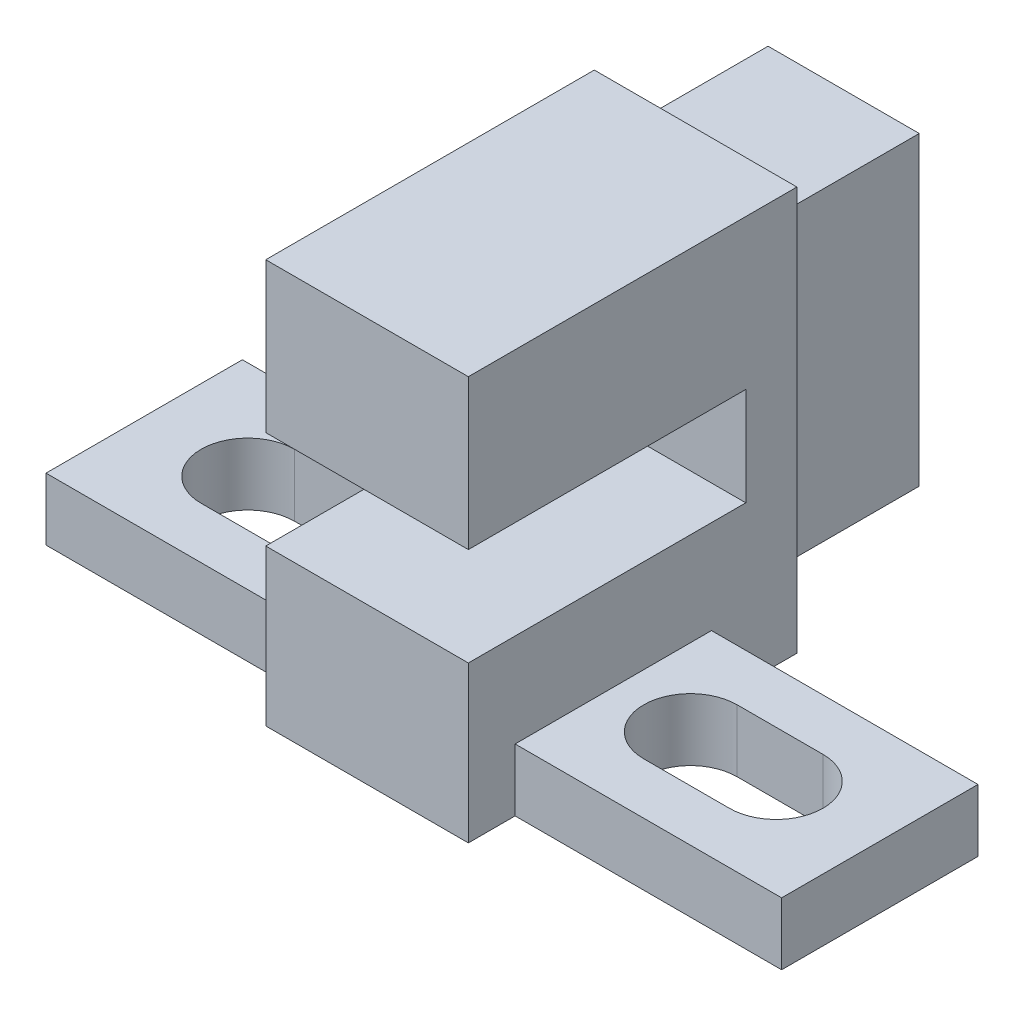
ISO-10303-21;
HEADER;
FILE_DESCRIPTION(('STEP AP214'),'2;1');
FILE_NAME('part.step','',(''),(''),'','','');
FILE_SCHEMA(('AUTOMOTIVE_DESIGN { 1 0 10303 214 1 1 1 1 }'));
ENDSEC;
DATA;
#1=APPLICATION_CONTEXT('core data for automotive mechanical design processes');
#2=APPLICATION_PROTOCOL_DEFINITION('international standard','automotive_design',2000,#1);
#3=PRODUCT_CONTEXT('',#1,'mechanical');
#4=PRODUCT('Part','Part','',(#3));
#5=PRODUCT_RELATED_PRODUCT_CATEGORY('part','',(#4));
#6=PRODUCT_DEFINITION_FORMATION('','',#4);
#7=PRODUCT_DEFINITION_CONTEXT('part definition',#1,'design');
#8=PRODUCT_DEFINITION('design','',#6,#7);
#9=PRODUCT_DEFINITION_SHAPE('','',#8);
#10=(LENGTH_UNIT() NAMED_UNIT(*) SI_UNIT(.MILLI.,.METRE.));
#11=(NAMED_UNIT(*) PLANE_ANGLE_UNIT() SI_UNIT($,.RADIAN.));
#12=(NAMED_UNIT(*) SI_UNIT($,.STERADIAN.) SOLID_ANGLE_UNIT());
#13=UNCERTAINTY_MEASURE_WITH_UNIT(LENGTH_MEASURE(1.E-05),#10,'distance_accuracy_value','');
#14=(GEOMETRIC_REPRESENTATION_CONTEXT(3) GLOBAL_UNCERTAINTY_ASSIGNED_CONTEXT((#13)) GLOBAL_UNIT_ASSIGNED_CONTEXT((#10,
#11,#12)) REPRESENTATION_CONTEXT('',''));
#15=CARTESIAN_POINT('',(0.,0.,0.));
#16=DIRECTION('',(0.,0.,1.));
#17=DIRECTION('',(1.,0.,0.));
#18=AXIS2_PLACEMENT_3D('',#15,#16,#17);
#19=CARTESIAN_POINT('',(3.25,0.,-10.54));
#20=DIRECTION('',(0.,0.,1.));
#21=DIRECTION('',(0.,-1.,0.));
#22=AXIS2_PLACEMENT_3D('',#19,#20,#21);
#23=PLANE('',#22);
#24=DIRECTION('',(0.,1.,0.));
#25=VECTOR('',#24,1.);
#26=CARTESIAN_POINT('',(-3.25,0.,-10.54));
#27=LINE('',#26,#25);
#28=CARTESIAN_POINT('',(-3.25,0.,-10.54));
#29=VERTEX_POINT('',#28);
#30=CARTESIAN_POINT('',(-3.25,12.954,-10.54));
#31=VERTEX_POINT('',#30);
#32=EDGE_CURVE('E372',#29,#31,#27,.T.);
#33=ORIENTED_EDGE('',*,*,#32,.T.);
#34=DIRECTION('',(-1.,0.,0.));
#35=VECTOR('',#34,1.);
#36=CARTESIAN_POINT('',(3.25,12.954,-10.54));
#37=LINE('',#36,#35);
#38=CARTESIAN_POINT('',(3.25,12.954,-10.54));
#39=VERTEX_POINT('',#38);
#40=EDGE_CURVE('E378',#39,#31,#37,.T.);
#41=ORIENTED_EDGE('',*,*,#40,.F.);
#42=DIRECTION('',(0.,1.,0.));
#43=VECTOR('',#42,1.);
#44=CARTESIAN_POINT('',(3.25,0.,-10.54));
#45=LINE('',#44,#43);
#46=CARTESIAN_POINT('',(3.25,0.,-10.54));
#47=VERTEX_POINT('',#46);
#48=EDGE_CURVE('E360',#47,#39,#45,.T.);
#49=ORIENTED_EDGE('',*,*,#48,.F.);
#50=DIRECTION('',(-1.,0.,0.));
#51=VECTOR('',#50,1.);
#52=CARTESIAN_POINT('',(3.25,0.,-10.54));
#53=LINE('',#52,#51);
#54=EDGE_CURVE('E381',#47,#29,#53,.T.);
#55=ORIENTED_EDGE('',*,*,#54,.T.);
#56=EDGE_LOOP('',(#33,#41,#49,#55));
#57=FACE_BOUND('',#56,.T.);
#58=DIRECTION('',(0.,1.,0.));
#59=VECTOR('',#58,1.);
#60=CARTESIAN_POINT('',(-2.425,1.854,-10.54));
#61=LINE('',#60,#59);
#62=CARTESIAN_POINT('',(-2.425,1.854,-10.54));
#63=VERTEX_POINT('',#62);
#64=CARTESIAN_POINT('',(-2.425,11.654,-10.54));
#65=VERTEX_POINT('',#64);
#66=EDGE_CURVE('E236',#63,#65,#61,.T.);
#67=ORIENTED_EDGE('',*,*,#66,.F.);
#68=DIRECTION('',(-1.,0.,0.));
#69=VECTOR('',#68,1.);
#70=CARTESIAN_POINT('',(2.425,1.854,-10.54));
#71=LINE('',#70,#69);
#72=CARTESIAN_POINT('',(2.425,1.854,-10.54));
#73=VERTEX_POINT('',#72);
#74=EDGE_CURVE('E233',#73,#63,#71,.T.);
#75=ORIENTED_EDGE('',*,*,#74,.F.);
#76=DIRECTION('',(0.,-1.,0.));
#77=VECTOR('',#76,1.);
#78=CARTESIAN_POINT('',(2.425,1.854,-10.54));
#79=LINE('',#78,#77);
#80=CARTESIAN_POINT('',(2.425,11.654,-10.54));
#81=VERTEX_POINT('',#80);
#82=EDGE_CURVE('E52',#81,#73,#79,.T.);
#83=ORIENTED_EDGE('',*,*,#82,.F.);
#84=DIRECTION('',(1.,0.,0.));
#85=VECTOR('',#84,1.);
#86=CARTESIAN_POINT('',(2.425,11.654,-10.54));
#87=LINE('',#86,#85);
#88=EDGE_CURVE('E47',#65,#81,#87,.T.);
#89=ORIENTED_EDGE('',*,*,#88,.F.);
#90=EDGE_LOOP('',(#67,#75,#83,#89));
#91=FACE_BOUND('',#90,.T.);
#92=ADVANCED_FACE('F32',(#57,#91),#23,.F.);
#93=CARTESIAN_POINT('',(3.25,0.,0.));
#94=DIRECTION('',(0.,0.,-1.));
#95=DIRECTION('',(0.,1.,0.));
#96=AXIS2_PLACEMENT_3D('',#93,#94,#95);
#97=PLANE('',#96);
#98=DIRECTION('',(0.,-1.,0.));
#99=VECTOR('',#98,1.);
#100=CARTESIAN_POINT('',(-3.25,0.,0.));
#101=LINE('',#100,#99);
#102=CARTESIAN_POINT('',(-3.25,12.954,0.));
#103=VERTEX_POINT('',#102);
#104=CARTESIAN_POINT('',(-3.25,8.15,0.));
#105=VERTEX_POINT('',#104);
#106=EDGE_CURVE('E365',#103,#105,#101,.T.);
#107=ORIENTED_EDGE('',*,*,#106,.T.);
#108=DIRECTION('',(1.,0.,0.));
#109=VECTOR('',#108,1.);
#110=CARTESIAN_POINT('',(-3.25,8.15,0.));
#111=LINE('',#110,#109);
#112=CARTESIAN_POINT('',(3.25,8.15,0.));
#113=VERTEX_POINT('',#112);
#114=EDGE_CURVE('E344',#105,#113,#111,.T.);
#115=ORIENTED_EDGE('',*,*,#114,.T.);
#116=DIRECTION('',(0.,-1.,0.));
#117=VECTOR('',#116,1.);
#118=CARTESIAN_POINT('',(3.25,0.,0.));
#119=LINE('',#118,#117);
#120=CARTESIAN_POINT('',(3.25,12.954,0.));
#121=VERTEX_POINT('',#120);
#122=EDGE_CURVE('E353',#121,#113,#119,.T.);
#123=ORIENTED_EDGE('',*,*,#122,.F.);
#124=DIRECTION('',(-1.,0.,0.));
#125=VECTOR('',#124,1.);
#126=CARTESIAN_POINT('',(3.25,12.954,0.));
#127=LINE('',#126,#125);
#128=EDGE_CURVE('E364',#121,#103,#127,.T.);
#129=ORIENTED_EDGE('',*,*,#128,.T.);
#130=EDGE_LOOP('',(#107,#115,#123,#129));
#131=FACE_BOUND('',#130,.T.);
#132=ADVANCED_FACE('F502',(#131),#97,.F.);
#133=CARTESIAN_POINT('',(3.25,5.,0.));
#134=VERTEX_POINT('',#133);
#135=CARTESIAN_POINT('',(3.25,0.,0.));
#136=VERTEX_POINT('',#135);
#137=EDGE_CURVE('E357',#134,#136,#119,.T.);
#138=ORIENTED_EDGE('',*,*,#137,.F.);
#139=DIRECTION('',(1.,0.,0.));
#140=VECTOR('',#139,1.);
#141=CARTESIAN_POINT('',(-3.25,5.,0.));
#142=LINE('',#141,#140);
#143=CARTESIAN_POINT('',(-3.25,5.,0.));
#144=VERTEX_POINT('',#143);
#145=EDGE_CURVE('E337',#144,#134,#142,.T.);
#146=ORIENTED_EDGE('',*,*,#145,.F.);
#147=CARTESIAN_POINT('',(-3.25,0.,0.));
#148=VERTEX_POINT('',#147);
#149=EDGE_CURVE('E347',#144,#148,#101,.T.);
#150=ORIENTED_EDGE('',*,*,#149,.T.);
#151=DIRECTION('',(-1.,0.,0.));
#152=VECTOR('',#151,1.);
#153=CARTESIAN_POINT('',(3.25,0.,0.));
#154=LINE('',#153,#152);
#155=EDGE_CURVE('E384',#136,#148,#154,.T.);
#156=ORIENTED_EDGE('',*,*,#155,.F.);
#157=EDGE_LOOP('',(#138,#146,#150,#156));
#158=FACE_BOUND('',#157,.T.);
#159=ADVANCED_FACE('F34',(#158),#97,.F.);
#160=CARTESIAN_POINT('',(3.25,0.,0.));
#161=DIRECTION('',(0.,1.,0.));
#162=DIRECTION('',(0.,0.,1.));
#163=AXIS2_PLACEMENT_3D('',#160,#161,#162);
#164=PLANE('',#163);
#165=DIRECTION('',(1.,0.,0.));
#166=VECTOR('',#165,1.);
#167=CARTESIAN_POINT('',(5.725,0.,-6.15));
#168=LINE('',#167,#166);
#169=CARTESIAN_POINT('',(5.725,0.,-6.15));
#170=VERTEX_POINT('',#169);
#171=CARTESIAN_POINT('',(8.475,0.,-6.15));
#172=VERTEX_POINT('',#171);
#173=EDGE_CURVE('E239',#170,#172,#168,.T.);
#174=ORIENTED_EDGE('',*,*,#173,.F.);
#175=CARTESIAN_POINT('',(5.725,0.,-4.65));
#176=DIRECTION('',(0.,-1.,0.));
#177=DIRECTION('',(0.,0.,-1.));
#178=AXIS2_PLACEMENT_3D('',#175,#176,#177);
#179=CIRCLE('',#178,1.5);
#180=CARTESIAN_POINT('',(5.725,0.,-3.15));
#181=VERTEX_POINT('',#180);
#182=EDGE_CURVE('E237',#181,#170,#179,.T.);
#183=ORIENTED_EDGE('',*,*,#182,.F.);
#184=DIRECTION('',(-1.,0.,0.));
#185=VECTOR('',#184,1.);
#186=CARTESIAN_POINT('',(5.725,0.,-3.15));
#187=LINE('',#186,#185);
#188=CARTESIAN_POINT('',(8.475,0.,-3.15));
#189=VERTEX_POINT('',#188);
#190=EDGE_CURVE('E250',#189,#181,#187,.T.);
#191=ORIENTED_EDGE('',*,*,#190,.F.);
#192=CARTESIAN_POINT('',(8.475,0.,-4.65));
#193=DIRECTION('',(0.,-1.,0.));
#194=DIRECTION('',(0.,0.,-1.));
#195=AXIS2_PLACEMENT_3D('',#192,#193,#194);
#196=CIRCLE('',#195,1.5);
#197=EDGE_CURVE('E247',#172,#189,#196,.T.);
#198=ORIENTED_EDGE('',*,*,#197,.F.);
#199=EDGE_LOOP('',(#174,#183,#191,#198));
#200=FACE_BOUND('',#199,.T.);
#201=DIRECTION('',(1.,0.,0.));
#202=VECTOR('',#201,1.);
#203=CARTESIAN_POINT('',(-8.475,0.,-6.15));
#204=LINE('',#203,#202);
#205=CARTESIAN_POINT('',(-8.475,0.,-6.15));
#206=VERTEX_POINT('',#205);
#207=CARTESIAN_POINT('',(-5.725,0.,-6.15));
#208=VERTEX_POINT('',#207);
#209=EDGE_CURVE('E264',#206,#208,#204,.T.);
#210=ORIENTED_EDGE('',*,*,#209,.F.);
#211=CARTESIAN_POINT('',(-8.475,0.,-4.65));
#212=DIRECTION('',(0.,-1.,0.));
#213=DIRECTION('',(0.,0.,-1.));
#214=AXIS2_PLACEMENT_3D('',#211,#212,#213);
#215=CIRCLE('',#214,1.5);
#216=CARTESIAN_POINT('',(-8.475,0.,-3.15));
#217=VERTEX_POINT('',#216);
#218=EDGE_CURVE('E256',#217,#206,#215,.T.);
#219=ORIENTED_EDGE('',*,*,#218,.F.);
#220=DIRECTION('',(-1.,0.,0.));
#221=VECTOR('',#220,1.);
#222=CARTESIAN_POINT('',(-8.475,0.,-3.15));
#223=LINE('',#222,#221);
#224=CARTESIAN_POINT('',(-5.725,0.,-3.15));
#225=VERTEX_POINT('',#224);
#226=EDGE_CURVE('E270',#225,#217,#223,.T.);
#227=ORIENTED_EDGE('',*,*,#226,.F.);
#228=CARTESIAN_POINT('',(-5.725,0.,-4.65));
#229=DIRECTION('',(0.,-1.,0.));
#230=DIRECTION('',(0.,0.,-1.));
#231=AXIS2_PLACEMENT_3D('',#228,#229,#230);
#232=CIRCLE('',#231,1.5);
#233=EDGE_CURVE('E267',#208,#225,#232,.T.);
#234=ORIENTED_EDGE('',*,*,#233,.F.);
#235=EDGE_LOOP('',(#210,#219,#227,#234));
#236=FACE_BOUND('',#235,.T.);
#237=DIRECTION('',(0.,0.,-1.));
#238=VECTOR('',#237,1.);
#239=CARTESIAN_POINT('',(-3.25,0.,0.));
#240=LINE('',#239,#238);
#241=CARTESIAN_POINT('',(-3.25,0.,-1.5));
#242=VERTEX_POINT('',#241);
#243=EDGE_CURVE('E369',#148,#242,#240,.T.);
#244=ORIENTED_EDGE('',*,*,#243,.T.);
#245=DIRECTION('',(-1.,0.,0.));
#246=VECTOR('',#245,1.);
#247=CARTESIAN_POINT('',(-11.8,0.,-1.5));
#248=LINE('',#247,#246);
#249=CARTESIAN_POINT('',(-11.8,0.,-1.5));
#250=VERTEX_POINT('',#249);
#251=EDGE_CURVE('E301',#242,#250,#248,.T.);
#252=ORIENTED_EDGE('',*,*,#251,.T.);
#253=DIRECTION('',(0.,0.,-1.));
#254=VECTOR('',#253,1.);
#255=CARTESIAN_POINT('',(-11.8,0.,-7.8));
#256=LINE('',#255,#254);
#257=CARTESIAN_POINT('',(-11.8,0.,-7.8));
#258=VERTEX_POINT('',#257);
#259=EDGE_CURVE('E305',#250,#258,#256,.T.);
#260=ORIENTED_EDGE('',*,*,#259,.T.);
#261=DIRECTION('',(1.,0.,0.));
#262=VECTOR('',#261,1.);
#263=CARTESIAN_POINT('',(-11.8,0.,-7.8));
#264=LINE('',#263,#262);
#265=CARTESIAN_POINT('',(-3.25,0.,-7.8));
#266=VERTEX_POINT('',#265);
#267=EDGE_CURVE('E287',#258,#266,#264,.T.);
#268=ORIENTED_EDGE('',*,*,#267,.T.);
#269=EDGE_CURVE('E368',#266,#29,#240,.T.);
#270=ORIENTED_EDGE('',*,*,#269,.T.);
#271=ORIENTED_EDGE('',*,*,#54,.F.);
#272=DIRECTION('',(0.,0.,-1.));
#273=VECTOR('',#272,1.);
#274=CARTESIAN_POINT('',(3.25,0.,0.));
#275=LINE('',#274,#273);
#276=CARTESIAN_POINT('',(3.25,0.,-7.8));
#277=VERTEX_POINT('',#276);
#278=EDGE_CURVE('E356',#277,#47,#275,.T.);
#279=ORIENTED_EDGE('',*,*,#278,.F.);
#280=CARTESIAN_POINT('',(11.8,0.,-7.8));
#281=VERTEX_POINT('',#280);
#282=EDGE_CURVE('E308',#277,#281,#264,.T.);
#283=ORIENTED_EDGE('',*,*,#282,.T.);
#284=DIRECTION('',(0.,0.,1.));
#285=VECTOR('',#284,1.);
#286=CARTESIAN_POINT('',(11.8,0.,-7.8));
#287=LINE('',#286,#285);
#288=CARTESIAN_POINT('',(11.8,0.,-1.5));
#289=VERTEX_POINT('',#288);
#290=EDGE_CURVE('E276',#281,#289,#287,.T.);
#291=ORIENTED_EDGE('',*,*,#290,.T.);
#292=CARTESIAN_POINT('',(3.25,0.,-1.5));
#293=VERTEX_POINT('',#292);
#294=EDGE_CURVE('E302',#289,#293,#248,.T.);
#295=ORIENTED_EDGE('',*,*,#294,.T.);
#296=EDGE_CURVE('E358',#136,#293,#275,.T.);
#297=ORIENTED_EDGE('',*,*,#296,.F.);
#298=ORIENTED_EDGE('',*,*,#155,.T.);
#299=EDGE_LOOP('',(#244,#252,#260,#268,#270,#271,#279,#283,#291,#295,#297,#298));
#300=FACE_BOUND('',#299,.T.);
#301=ADVANCED_FACE('F430',(#200,#236,#300),#164,.F.);
#302=CARTESIAN_POINT('',(3.25,12.954,0.));
#303=DIRECTION('',(0.,-1.,0.));
#304=DIRECTION('',(0.,0.,-1.));
#305=AXIS2_PLACEMENT_3D('',#302,#303,#304);
#306=PLANE('',#305);
#307=DIRECTION('',(0.,0.,1.));
#308=VECTOR('',#307,1.);
#309=CARTESIAN_POINT('',(-3.25,12.954,0.));
#310=LINE('',#309,#308);
#311=EDGE_CURVE('E374',#31,#103,#310,.T.);
#312=ORIENTED_EDGE('',*,*,#311,.T.);
#313=ORIENTED_EDGE('',*,*,#128,.F.);
#314=DIRECTION('',(0.,0.,1.));
#315=VECTOR('',#314,1.);
#316=CARTESIAN_POINT('',(3.25,12.954,0.));
#317=LINE('',#316,#315);
#318=EDGE_CURVE('E362',#39,#121,#317,.T.);
#319=ORIENTED_EDGE('',*,*,#318,.F.);
#320=ORIENTED_EDGE('',*,*,#40,.T.);
#321=EDGE_LOOP('',(#312,#313,#319,#320));
#322=FACE_BOUND('',#321,.T.);
#323=ADVANCED_FACE('F433',(#322),#306,.F.);
#324=CARTESIAN_POINT('',(3.25,0.,0.));
#325=DIRECTION('',(-1.,0.,0.));
#326=DIRECTION('',(0.,0.,1.));
#327=AXIS2_PLACEMENT_3D('',#324,#325,#326);
#328=PLANE('',#327);
#329=DIRECTION('',(0.,0.,-1.));
#330=VECTOR('',#329,1.);
#331=CARTESIAN_POINT('',(3.25,2.,0.));
#332=LINE('',#331,#330);
#333=CARTESIAN_POINT('',(3.25,2.,-1.5));
#334=VERTEX_POINT('',#333);
#335=CARTESIAN_POINT('',(3.25,2.,-7.8));
#336=VERTEX_POINT('',#335);
#337=EDGE_CURVE('E313',#334,#336,#332,.T.);
#338=ORIENTED_EDGE('',*,*,#337,.T.);
#339=DIRECTION('',(0.,-1.,0.));
#340=VECTOR('',#339,1.);
#341=CARTESIAN_POINT('',(3.25,0.,-7.8));
#342=LINE('',#341,#340);
#343=EDGE_CURVE('E323',#336,#277,#342,.T.);
#344=ORIENTED_EDGE('',*,*,#343,.T.);
#345=ORIENTED_EDGE('',*,*,#278,.T.);
#346=ORIENTED_EDGE('',*,*,#48,.T.);
#347=ORIENTED_EDGE('',*,*,#318,.T.);
#348=ORIENTED_EDGE('',*,*,#122,.T.);
#349=DIRECTION('',(0.,0.,1.));
#350=VECTOR('',#349,1.);
#351=CARTESIAN_POINT('',(3.25,8.15,0.));
#352=LINE('',#351,#350);
#353=CARTESIAN_POINT('',(3.25,8.15,-8.9));
#354=VERTEX_POINT('',#353);
#355=EDGE_CURVE('E331',#354,#113,#352,.T.);
#356=ORIENTED_EDGE('',*,*,#355,.F.);
#357=DIRECTION('',(0.,1.,0.));
#358=VECTOR('',#357,1.);
#359=CARTESIAN_POINT('',(3.25,5.,-8.9));
#360=LINE('',#359,#358);
#361=CARTESIAN_POINT('',(3.25,5.,-8.9));
#362=VERTEX_POINT('',#361);
#363=EDGE_CURVE('E340',#362,#354,#360,.T.);
#364=ORIENTED_EDGE('',*,*,#363,.F.);
#365=DIRECTION('',(0.,0.,-1.));
#366=VECTOR('',#365,1.);
#367=CARTESIAN_POINT('',(3.25,5.,0.));
#368=LINE('',#367,#366);
#369=EDGE_CURVE('E326',#134,#362,#368,.T.);
#370=ORIENTED_EDGE('',*,*,#369,.F.);
#371=ORIENTED_EDGE('',*,*,#137,.T.);
#372=ORIENTED_EDGE('',*,*,#296,.T.);
#373=DIRECTION('',(0.,1.,0.));
#374=VECTOR('',#373,1.);
#375=CARTESIAN_POINT('',(3.25,0.,-1.5));
#376=LINE('',#375,#374);
#377=EDGE_CURVE('E321',#293,#334,#376,.T.);
#378=ORIENTED_EDGE('',*,*,#377,.T.);
#379=EDGE_LOOP('',(#338,#344,#345,#346,#347,#348,#356,#364,#370,#371,#372,#378));
#380=FACE_BOUND('',#379,.T.);
#381=ADVANCED_FACE('F470',(#380),#328,.F.);
#382=CARTESIAN_POINT('',(-3.25,0.,0.));
#383=DIRECTION('',(-1.,0.,0.));
#384=DIRECTION('',(0.,0.,1.));
#385=AXIS2_PLACEMENT_3D('',#382,#383,#384);
#386=PLANE('',#385);
#387=DIRECTION('',(0.,-1.,0.));
#388=VECTOR('',#387,1.);
#389=CARTESIAN_POINT('',(-3.25,0.,-7.8));
#390=LINE('',#389,#388);
#391=CARTESIAN_POINT('',(-3.25,2.,-7.8));
#392=VERTEX_POINT('',#391);
#393=EDGE_CURVE('E391',#392,#266,#390,.T.);
#394=ORIENTED_EDGE('',*,*,#393,.F.);
#395=DIRECTION('',(0.,0.,-1.));
#396=VECTOR('',#395,1.);
#397=CARTESIAN_POINT('',(-3.25,2.,0.));
#398=LINE('',#397,#396);
#399=CARTESIAN_POINT('',(-3.25,2.,-1.5));
#400=VERTEX_POINT('',#399);
#401=EDGE_CURVE('E387',#400,#392,#398,.T.);
#402=ORIENTED_EDGE('',*,*,#401,.F.);
#403=DIRECTION('',(0.,1.,0.));
#404=VECTOR('',#403,1.);
#405=CARTESIAN_POINT('',(-3.25,0.,-1.5));
#406=LINE('',#405,#404);
#407=EDGE_CURVE('E389',#242,#400,#406,.T.);
#408=ORIENTED_EDGE('',*,*,#407,.F.);
#409=ORIENTED_EDGE('',*,*,#243,.F.);
#410=ORIENTED_EDGE('',*,*,#149,.F.);
#411=DIRECTION('',(0.,0.,-1.));
#412=VECTOR('',#411,1.);
#413=CARTESIAN_POINT('',(-3.25,5.,0.));
#414=LINE('',#413,#412);
#415=CARTESIAN_POINT('',(-3.25,5.,-8.9));
#416=VERTEX_POINT('',#415);
#417=EDGE_CURVE('E327',#144,#416,#414,.T.);
#418=ORIENTED_EDGE('',*,*,#417,.T.);
#419=DIRECTION('',(0.,1.,0.));
#420=VECTOR('',#419,1.);
#421=CARTESIAN_POINT('',(-3.25,5.,-8.9));
#422=LINE('',#421,#420);
#423=CARTESIAN_POINT('',(-3.25,8.15,-8.9));
#424=VERTEX_POINT('',#423);
#425=EDGE_CURVE('E330',#416,#424,#422,.T.);
#426=ORIENTED_EDGE('',*,*,#425,.T.);
#427=DIRECTION('',(0.,0.,1.));
#428=VECTOR('',#427,1.);
#429=CARTESIAN_POINT('',(-3.25,8.15,0.));
#430=LINE('',#429,#428);
#431=EDGE_CURVE('E334',#424,#105,#430,.T.);
#432=ORIENTED_EDGE('',*,*,#431,.T.);
#433=ORIENTED_EDGE('',*,*,#106,.F.);
#434=ORIENTED_EDGE('',*,*,#311,.F.);
#435=ORIENTED_EDGE('',*,*,#32,.F.);
#436=ORIENTED_EDGE('',*,*,#269,.F.);
#437=EDGE_LOOP('',(#394,#402,#408,#409,#410,#418,#426,#432,#433,#434,#435,#436));
#438=FACE_BOUND('',#437,.T.);
#439=ADVANCED_FACE('F445',(#438),#386,.T.);
#440=CARTESIAN_POINT('',(-3.25,8.15,0.));
#441=DIRECTION('',(0.,1.,0.));
#442=DIRECTION('',(0.,0.,1.));
#443=AXIS2_PLACEMENT_3D('',#440,#441,#442);
#444=PLANE('',#443);
#445=ORIENTED_EDGE('',*,*,#355,.T.);
#446=ORIENTED_EDGE('',*,*,#114,.F.);
#447=ORIENTED_EDGE('',*,*,#431,.F.);
#448=DIRECTION('',(1.,0.,0.));
#449=VECTOR('',#448,1.);
#450=CARTESIAN_POINT('',(-3.25,8.15,-8.9));
#451=LINE('',#450,#449);
#452=EDGE_CURVE('E348',#424,#354,#451,.T.);
#453=ORIENTED_EDGE('',*,*,#452,.T.);
#454=EDGE_LOOP('',(#445,#446,#447,#453));
#455=FACE_BOUND('',#454,.T.);
#456=ADVANCED_FACE('F686',(#455),#444,.F.);
#457=CARTESIAN_POINT('',(-3.25,5.,-8.9));
#458=DIRECTION('',(0.,0.,-1.));
#459=DIRECTION('',(-1.,0.,0.));
#460=AXIS2_PLACEMENT_3D('',#457,#458,#459);
#461=PLANE('',#460);
#462=ORIENTED_EDGE('',*,*,#363,.T.);
#463=ORIENTED_EDGE('',*,*,#452,.F.);
#464=ORIENTED_EDGE('',*,*,#425,.F.);
#465=DIRECTION('',(1.,0.,0.));
#466=VECTOR('',#465,1.);
#467=CARTESIAN_POINT('',(-3.25,5.,-8.9));
#468=LINE('',#467,#466);
#469=EDGE_CURVE('E350',#416,#362,#468,.T.);
#470=ORIENTED_EDGE('',*,*,#469,.T.);
#471=EDGE_LOOP('',(#462,#463,#464,#470));
#472=FACE_BOUND('',#471,.T.);
#473=ADVANCED_FACE('F497',(#472),#461,.F.);
#474=CARTESIAN_POINT('',(-3.25,5.,0.));
#475=DIRECTION('',(0.,-1.,0.));
#476=DIRECTION('',(0.,0.,-1.));
#477=AXIS2_PLACEMENT_3D('',#474,#475,#476);
#478=PLANE('',#477);
#479=ORIENTED_EDGE('',*,*,#369,.T.);
#480=ORIENTED_EDGE('',*,*,#469,.F.);
#481=ORIENTED_EDGE('',*,*,#417,.F.);
#482=ORIENTED_EDGE('',*,*,#145,.T.);
#483=EDGE_LOOP('',(#479,#480,#481,#482));
#484=FACE_BOUND('',#483,.T.);
#485=ADVANCED_FACE('F492',(#484),#478,.F.);
#486=CARTESIAN_POINT('',(-11.8,2.,-7.8));
#487=DIRECTION('',(-1.,0.,0.));
#488=DIRECTION('',(0.,0.,1.));
#489=AXIS2_PLACEMENT_3D('',#486,#487,#488);
#490=PLANE('',#489);
#491=ORIENTED_EDGE('',*,*,#259,.F.);
#492=DIRECTION('',(0.,-1.,0.));
#493=VECTOR('',#492,1.);
#494=CARTESIAN_POINT('',(-11.8,2.,-1.5));
#495=LINE('',#494,#493);
#496=CARTESIAN_POINT('',(-11.8,2.,-1.5));
#497=VERTEX_POINT('',#496);
#498=EDGE_CURVE('E316',#497,#250,#495,.T.);
#499=ORIENTED_EDGE('',*,*,#498,.F.);
#500=DIRECTION('',(0.,0.,-1.));
#501=VECTOR('',#500,1.);
#502=CARTESIAN_POINT('',(-11.8,2.,-7.8));
#503=LINE('',#502,#501);
#504=CARTESIAN_POINT('',(-11.8,2.,-7.8));
#505=VERTEX_POINT('',#504);
#506=EDGE_CURVE('E291',#497,#505,#503,.T.);
#507=ORIENTED_EDGE('',*,*,#506,.T.);
#508=DIRECTION('',(0.,-1.,0.));
#509=VECTOR('',#508,1.);
#510=CARTESIAN_POINT('',(-11.8,2.,-7.8));
#511=LINE('',#510,#509);
#512=EDGE_CURVE('E314',#505,#258,#511,.T.);
#513=ORIENTED_EDGE('',*,*,#512,.T.);
#514=EDGE_LOOP('',(#491,#499,#507,#513));
#515=FACE_BOUND('',#514,.T.);
#516=ADVANCED_FACE('F457',(#515),#490,.T.);
#517=CARTESIAN_POINT('',(0.,2.,0.));
#518=DIRECTION('',(0.,1.,0.));
#519=DIRECTION('',(0.,0.,1.));
#520=AXIS2_PLACEMENT_3D('',#517,#518,#519);
#521=PLANE('',#520);
#522=CARTESIAN_POINT('',(-8.475,2.,-4.65));
#523=DIRECTION('',(0.,1.,0.));
#524=DIRECTION('',(0.,0.,1.));
#525=AXIS2_PLACEMENT_3D('',#522,#523,#524);
#526=CIRCLE('',#525,1.5);
#527=CARTESIAN_POINT('',(-8.475,2.,-6.15));
#528=VERTEX_POINT('',#527);
#529=CARTESIAN_POINT('',(-8.475,2.,-3.15));
#530=VERTEX_POINT('',#529);
#531=EDGE_CURVE('E401',#528,#530,#526,.T.);
#532=ORIENTED_EDGE('',*,*,#531,.F.);
#533=DIRECTION('',(-1.,0.,0.));
#534=VECTOR('',#533,1.);
#535=CARTESIAN_POINT('',(0.,2.,-6.15));
#536=LINE('',#535,#534);
#537=CARTESIAN_POINT('',(-5.725,2.,-6.15));
#538=VERTEX_POINT('',#537);
#539=EDGE_CURVE('E394',#538,#528,#536,.T.);
#540=ORIENTED_EDGE('',*,*,#539,.F.);
#541=CARTESIAN_POINT('',(-5.725,2.,-4.65));
#542=DIRECTION('',(0.,1.,0.));
#543=DIRECTION('',(0.,0.,1.));
#544=AXIS2_PLACEMENT_3D('',#541,#542,#543);
#545=CIRCLE('',#544,1.5);
#546=CARTESIAN_POINT('',(-5.725,2.,-3.15));
#547=VERTEX_POINT('',#546);
#548=EDGE_CURVE('E396',#547,#538,#545,.T.);
#549=ORIENTED_EDGE('',*,*,#548,.F.);
#550=DIRECTION('',(1.,0.,0.));
#551=VECTOR('',#550,1.);
#552=CARTESIAN_POINT('',(0.,2.,-3.15));
#553=LINE('',#552,#551);
#554=EDGE_CURVE('E399',#530,#547,#553,.T.);
#555=ORIENTED_EDGE('',*,*,#554,.F.);
#556=EDGE_LOOP('',(#532,#540,#549,#555));
#557=FACE_BOUND('',#556,.T.);
#558=DIRECTION('',(-1.,0.,0.));
#559=VECTOR('',#558,1.);
#560=CARTESIAN_POINT('',(-11.8,2.,-1.5));
#561=LINE('',#560,#559);
#562=EDGE_CURVE('E286',#400,#497,#561,.T.);
#563=ORIENTED_EDGE('',*,*,#562,.F.);
#564=ORIENTED_EDGE('',*,*,#401,.T.);
#565=DIRECTION('',(1.,0.,0.));
#566=VECTOR('',#565,1.);
#567=CARTESIAN_POINT('',(-11.8,2.,-7.8));
#568=LINE('',#567,#566);
#569=EDGE_CURVE('E295',#505,#392,#568,.T.);
#570=ORIENTED_EDGE('',*,*,#569,.F.);
#571=ORIENTED_EDGE('',*,*,#506,.F.);
#572=EDGE_LOOP('',(#563,#564,#570,#571));
#573=FACE_BOUND('',#572,.T.);
#574=ADVANCED_FACE('F453',(#557,#573),#521,.T.);
#575=CARTESIAN_POINT('',(-11.8,2.,-1.5));
#576=DIRECTION('',(0.,0.,1.));
#577=DIRECTION('',(1.,0.,0.));
#578=AXIS2_PLACEMENT_3D('',#575,#576,#577);
#579=PLANE('',#578);
#580=ORIENTED_EDGE('',*,*,#251,.F.);
#581=ORIENTED_EDGE('',*,*,#407,.T.);
#582=ORIENTED_EDGE('',*,*,#562,.T.);
#583=ORIENTED_EDGE('',*,*,#498,.T.);
#584=EDGE_LOOP('',(#580,#581,#582,#583));
#585=FACE_BOUND('',#584,.T.);
#586=ADVANCED_FACE('F449',(#585),#579,.T.);
#587=CARTESIAN_POINT('',(-11.8,2.,-7.8));
#588=DIRECTION('',(0.,0.,-1.));
#589=DIRECTION('',(-1.,0.,0.));
#590=AXIS2_PLACEMENT_3D('',#587,#588,#589);
#591=PLANE('',#590);
#592=ORIENTED_EDGE('',*,*,#569,.T.);
#593=ORIENTED_EDGE('',*,*,#393,.T.);
#594=ORIENTED_EDGE('',*,*,#267,.F.);
#595=ORIENTED_EDGE('',*,*,#512,.F.);
#596=EDGE_LOOP('',(#592,#593,#594,#595));
#597=FACE_BOUND('',#596,.T.);
#598=ADVANCED_FACE('F460',(#597),#591,.T.);
#599=ORIENTED_EDGE('',*,*,#343,.F.);
#600=CARTESIAN_POINT('',(11.8,2.,-7.8));
#601=VERTEX_POINT('',#600);
#602=EDGE_CURVE('E294',#336,#601,#568,.T.);
#603=ORIENTED_EDGE('',*,*,#602,.T.);
#604=DIRECTION('',(0.,-1.,0.));
#605=VECTOR('',#604,1.);
#606=CARTESIAN_POINT('',(11.8,2.,-7.8));
#607=LINE('',#606,#605);
#608=EDGE_CURVE('E310',#601,#281,#607,.T.);
#609=ORIENTED_EDGE('',*,*,#608,.T.);
#610=ORIENTED_EDGE('',*,*,#282,.F.);
#611=EDGE_LOOP('',(#599,#603,#609,#610));
#612=FACE_BOUND('',#611,.T.);
#613=ADVANCED_FACE('F477',(#612),#591,.T.);
#614=ORIENTED_EDGE('',*,*,#377,.F.);
#615=ORIENTED_EDGE('',*,*,#294,.F.);
#616=DIRECTION('',(0.,-1.,0.));
#617=VECTOR('',#616,1.);
#618=CARTESIAN_POINT('',(11.8,2.,-1.5));
#619=LINE('',#618,#617);
#620=CARTESIAN_POINT('',(11.8,2.,-1.5));
#621=VERTEX_POINT('',#620);
#622=EDGE_CURVE('E298',#621,#289,#619,.T.);
#623=ORIENTED_EDGE('',*,*,#622,.F.);
#624=EDGE_CURVE('E288',#621,#334,#561,.T.);
#625=ORIENTED_EDGE('',*,*,#624,.T.);
#626=EDGE_LOOP('',(#614,#615,#623,#625));
#627=FACE_BOUND('',#626,.T.);
#628=ADVANCED_FACE('F486',(#627),#579,.T.);
#629=CARTESIAN_POINT('',(5.725,2.,-4.65));
#630=DIRECTION('',(0.,1.,0.));
#631=DIRECTION('',(0.,0.,1.));
#632=AXIS2_PLACEMENT_3D('',#629,#630,#631);
#633=CIRCLE('',#632,1.5);
#634=CARTESIAN_POINT('',(5.725,2.,-6.15));
#635=VERTEX_POINT('',#634);
#636=CARTESIAN_POINT('',(5.725,2.,-3.15));
#637=VERTEX_POINT('',#636);
#638=EDGE_CURVE('E11',#635,#637,#633,.T.);
#639=ORIENTED_EDGE('',*,*,#638,.F.);
#640=DIRECTION('',(-1.,0.,0.));
#641=VECTOR('',#640,1.);
#642=CARTESIAN_POINT('',(0.,2.,-6.15));
#643=LINE('',#642,#641);
#644=CARTESIAN_POINT('',(8.475,2.,-6.15));
#645=VERTEX_POINT('',#644);
#646=EDGE_CURVE('E403',#645,#635,#643,.T.);
#647=ORIENTED_EDGE('',*,*,#646,.F.);
#648=CARTESIAN_POINT('',(8.475,2.,-4.65));
#649=DIRECTION('',(0.,1.,0.));
#650=DIRECTION('',(0.,0.,1.));
#651=AXIS2_PLACEMENT_3D('',#648,#649,#650);
#652=CIRCLE('',#651,1.5);
#653=CARTESIAN_POINT('',(8.475,2.,-3.15));
#654=VERTEX_POINT('',#653);
#655=EDGE_CURVE('E405',#654,#645,#652,.T.);
#656=ORIENTED_EDGE('',*,*,#655,.F.);
#657=DIRECTION('',(1.,0.,0.));
#658=VECTOR('',#657,1.);
#659=CARTESIAN_POINT('',(0.,2.,-3.15));
#660=LINE('',#659,#658);
#661=EDGE_CURVE('E40',#637,#654,#660,.T.);
#662=ORIENTED_EDGE('',*,*,#661,.F.);
#663=EDGE_LOOP('',(#639,#647,#656,#662));
#664=FACE_BOUND('',#663,.T.);
#665=ORIENTED_EDGE('',*,*,#337,.F.);
#666=ORIENTED_EDGE('',*,*,#624,.F.);
#667=DIRECTION('',(0.,0.,1.));
#668=VECTOR('',#667,1.);
#669=CARTESIAN_POINT('',(11.8,2.,-7.8));
#670=LINE('',#669,#668);
#671=EDGE_CURVE('E283',#601,#621,#670,.T.);
#672=ORIENTED_EDGE('',*,*,#671,.F.);
#673=ORIENTED_EDGE('',*,*,#602,.F.);
#674=EDGE_LOOP('',(#665,#666,#672,#673));
#675=FACE_BOUND('',#674,.T.);
#676=ADVANCED_FACE('F420',(#664,#675),#521,.T.);
#677=CARTESIAN_POINT('',(11.8,2.,-7.8));
#678=DIRECTION('',(1.,0.,0.));
#679=DIRECTION('',(0.,0.,-1.));
#680=AXIS2_PLACEMENT_3D('',#677,#678,#679);
#681=PLANE('',#680);
#682=ORIENTED_EDGE('',*,*,#290,.F.);
#683=ORIENTED_EDGE('',*,*,#608,.F.);
#684=ORIENTED_EDGE('',*,*,#671,.T.);
#685=ORIENTED_EDGE('',*,*,#622,.T.);
#686=EDGE_LOOP('',(#682,#683,#684,#685));
#687=FACE_BOUND('',#686,.T.);
#688=ADVANCED_FACE('F481',(#687),#681,.T.);
#689=CARTESIAN_POINT('',(-8.475,12.954,-4.65));
#690=DIRECTION('',(0.,-1.,0.));
#691=DIRECTION('',(0.,0.,-1.));
#692=AXIS2_PLACEMENT_3D('',#689,#690,#691);
#693=CYLINDRICAL_SURFACE('',#692,1.5);
#694=ORIENTED_EDGE('',*,*,#531,.T.);
#695=DIRECTION('',(0.,-1.,0.));
#696=VECTOR('',#695,1.);
#697=CARTESIAN_POINT('',(-8.475,12.954,-3.15));
#698=LINE('',#697,#696);
#699=EDGE_CURVE('E274',#530,#217,#698,.T.);
#700=ORIENTED_EDGE('',*,*,#699,.T.);
#701=ORIENTED_EDGE('',*,*,#218,.T.);
#702=DIRECTION('',(0.,-1.,0.));
#703=VECTOR('',#702,1.);
#704=CARTESIAN_POINT('',(-8.475,12.954,-6.15));
#705=LINE('',#704,#703);
#706=EDGE_CURVE('E273',#528,#206,#705,.T.);
#707=ORIENTED_EDGE('',*,*,#706,.F.);
#708=EDGE_LOOP('',(#694,#700,#701,#707));
#709=FACE_BOUND('',#708,.T.);
#710=ADVANCED_FACE('F561',(#709),#693,.F.);
#711=CARTESIAN_POINT('',(-8.475,12.954,-3.15));
#712=DIRECTION('',(0.,0.,1.));
#713=DIRECTION('',(1.,0.,0.));
#714=AXIS2_PLACEMENT_3D('',#711,#712,#713);
#715=PLANE('',#714);
#716=ORIENTED_EDGE('',*,*,#554,.T.);
#717=DIRECTION('',(0.,-1.,0.));
#718=VECTOR('',#717,1.);
#719=CARTESIAN_POINT('',(-5.725,12.954,-3.15));
#720=LINE('',#719,#718);
#721=EDGE_CURVE('E277',#547,#225,#720,.T.);
#722=ORIENTED_EDGE('',*,*,#721,.T.);
#723=ORIENTED_EDGE('',*,*,#226,.T.);
#724=ORIENTED_EDGE('',*,*,#699,.F.);
#725=EDGE_LOOP('',(#716,#722,#723,#724));
#726=FACE_BOUND('',#725,.T.);
#727=ADVANCED_FACE('F566',(#726),#715,.F.);
#728=CARTESIAN_POINT('',(-5.725,12.954,-4.65));
#729=DIRECTION('',(0.,-1.,0.));
#730=DIRECTION('',(0.,0.,-1.));
#731=AXIS2_PLACEMENT_3D('',#728,#729,#730);
#732=CYLINDRICAL_SURFACE('',#731,1.5);
#733=ORIENTED_EDGE('',*,*,#548,.T.);
#734=DIRECTION('',(0.,-1.,0.));
#735=VECTOR('',#734,1.);
#736=CARTESIAN_POINT('',(-5.725,12.954,-6.15));
#737=LINE('',#736,#735);
#738=EDGE_CURVE('E279',#538,#208,#737,.T.);
#739=ORIENTED_EDGE('',*,*,#738,.T.);
#740=ORIENTED_EDGE('',*,*,#233,.T.);
#741=ORIENTED_EDGE('',*,*,#721,.F.);
#742=EDGE_LOOP('',(#733,#739,#740,#741));
#743=FACE_BOUND('',#742,.T.);
#744=ADVANCED_FACE('F576',(#743),#732,.F.);
#745=CARTESIAN_POINT('',(-8.475,12.954,-6.15));
#746=DIRECTION('',(0.,0.,-1.));
#747=DIRECTION('',(-1.,0.,0.));
#748=AXIS2_PLACEMENT_3D('',#745,#746,#747);
#749=PLANE('',#748);
#750=ORIENTED_EDGE('',*,*,#539,.T.);
#751=ORIENTED_EDGE('',*,*,#706,.T.);
#752=ORIENTED_EDGE('',*,*,#209,.T.);
#753=ORIENTED_EDGE('',*,*,#738,.F.);
#754=EDGE_LOOP('',(#750,#751,#752,#753));
#755=FACE_BOUND('',#754,.T.);
#756=ADVANCED_FACE('F586',(#755),#749,.F.);
#757=CARTESIAN_POINT('',(5.725,12.954,-4.65));
#758=DIRECTION('',(0.,-1.,0.));
#759=DIRECTION('',(0.,0.,-1.));
#760=AXIS2_PLACEMENT_3D('',#757,#758,#759);
#761=CYLINDRICAL_SURFACE('',#760,1.5);
#762=ORIENTED_EDGE('',*,*,#638,.T.);
#763=DIRECTION('',(0.,-1.,0.));
#764=VECTOR('',#763,1.);
#765=CARTESIAN_POINT('',(5.725,12.954,-3.15));
#766=LINE('',#765,#764);
#767=EDGE_CURVE('E254',#637,#181,#766,.T.);
#768=ORIENTED_EDGE('',*,*,#767,.T.);
#769=ORIENTED_EDGE('',*,*,#182,.T.);
#770=DIRECTION('',(0.,-1.,0.));
#771=VECTOR('',#770,1.);
#772=CARTESIAN_POINT('',(5.725,12.954,-6.15));
#773=LINE('',#772,#771);
#774=EDGE_CURVE('E253',#635,#170,#773,.T.);
#775=ORIENTED_EDGE('',*,*,#774,.F.);
#776=EDGE_LOOP('',(#762,#768,#769,#775));
#777=FACE_BOUND('',#776,.T.);
#778=ADVANCED_FACE('F427',(#777),#761,.F.);
#779=CARTESIAN_POINT('',(5.725,12.954,-3.15));
#780=DIRECTION('',(0.,0.,1.));
#781=DIRECTION('',(1.,0.,0.));
#782=AXIS2_PLACEMENT_3D('',#779,#780,#781);
#783=PLANE('',#782);
#784=ORIENTED_EDGE('',*,*,#661,.T.);
#785=DIRECTION('',(0.,-1.,0.));
#786=VECTOR('',#785,1.);
#787=CARTESIAN_POINT('',(8.475,12.954,-3.15));
#788=LINE('',#787,#786);
#789=EDGE_CURVE('E257',#654,#189,#788,.T.);
#790=ORIENTED_EDGE('',*,*,#789,.T.);
#791=ORIENTED_EDGE('',*,*,#190,.T.);
#792=ORIENTED_EDGE('',*,*,#767,.F.);
#793=EDGE_LOOP('',(#784,#790,#791,#792));
#794=FACE_BOUND('',#793,.T.);
#795=ADVANCED_FACE('F411',(#794),#783,.F.);
#796=CARTESIAN_POINT('',(8.475,12.954,-4.65));
#797=DIRECTION('',(0.,-1.,0.));
#798=DIRECTION('',(0.,0.,-1.));
#799=AXIS2_PLACEMENT_3D('',#796,#797,#798);
#800=CYLINDRICAL_SURFACE('',#799,1.5);
#801=ORIENTED_EDGE('',*,*,#655,.T.);
#802=DIRECTION('',(0.,-1.,0.));
#803=VECTOR('',#802,1.);
#804=CARTESIAN_POINT('',(8.475,12.954,-6.15));
#805=LINE('',#804,#803);
#806=EDGE_CURVE('E259',#645,#172,#805,.T.);
#807=ORIENTED_EDGE('',*,*,#806,.T.);
#808=ORIENTED_EDGE('',*,*,#197,.T.);
#809=ORIENTED_EDGE('',*,*,#789,.F.);
#810=EDGE_LOOP('',(#801,#807,#808,#809));
#811=FACE_BOUND('',#810,.T.);
#812=ADVANCED_FACE('F416',(#811),#800,.F.);
#813=CARTESIAN_POINT('',(5.725,12.954,-6.15));
#814=DIRECTION('',(0.,0.,-1.));
#815=DIRECTION('',(-1.,0.,0.));
#816=AXIS2_PLACEMENT_3D('',#813,#814,#815);
#817=PLANE('',#816);
#818=ORIENTED_EDGE('',*,*,#646,.T.);
#819=ORIENTED_EDGE('',*,*,#774,.T.);
#820=ORIENTED_EDGE('',*,*,#173,.T.);
#821=ORIENTED_EDGE('',*,*,#806,.F.);
#822=EDGE_LOOP('',(#818,#819,#820,#821));
#823=FACE_BOUND('',#822,.T.);
#824=ADVANCED_FACE('F424',(#823),#817,.F.);
#825=CARTESIAN_POINT('',(-2.425,1.854,-15.29));
#826=DIRECTION('',(1.,0.,0.));
#827=DIRECTION('',(0.,0.,-1.));
#828=AXIS2_PLACEMENT_3D('',#825,#826,#827);
#829=PLANE('',#828);
#830=ORIENTED_EDGE('',*,*,#66,.T.);
#831=DIRECTION('',(0.,0.,1.));
#832=VECTOR('',#831,1.);
#833=CARTESIAN_POINT('',(-2.425,11.654,-15.29));
#834=LINE('',#833,#832);
#835=CARTESIAN_POINT('',(-2.425,11.654,-15.29));
#836=VERTEX_POINT('',#835);
#837=EDGE_CURVE('E217',#836,#65,#834,.T.);
#838=ORIENTED_EDGE('',*,*,#837,.F.);
#839=DIRECTION('',(0.,1.,0.));
#840=VECTOR('',#839,1.);
#841=CARTESIAN_POINT('',(-2.425,1.854,-15.29));
#842=LINE('',#841,#840);
#843=CARTESIAN_POINT('',(-2.425,1.854,-15.29));
#844=VERTEX_POINT('',#843);
#845=EDGE_CURVE('E224',#844,#836,#842,.T.);
#846=ORIENTED_EDGE('',*,*,#845,.F.);
#847=DIRECTION('',(0.,0.,1.));
#848=VECTOR('',#847,1.);
#849=CARTESIAN_POINT('',(-2.425,1.854,-15.29));
#850=LINE('',#849,#848);
#851=EDGE_CURVE('E763',#844,#63,#850,.T.);
#852=ORIENTED_EDGE('',*,*,#851,.T.);
#853=EDGE_LOOP('',(#830,#838,#846,#852));
#854=FACE_BOUND('',#853,.T.);
#855=ADVANCED_FACE('F235',(#854),#829,.F.);
#856=CARTESIAN_POINT('',(2.425,11.654,-15.29));
#857=DIRECTION('',(0.,-1.,0.));
#858=DIRECTION('',(0.,0.,-1.));
#859=AXIS2_PLACEMENT_3D('',#856,#857,#858);
#860=PLANE('',#859);
#861=ORIENTED_EDGE('',*,*,#88,.T.);
#862=DIRECTION('',(0.,0.,1.));
#863=VECTOR('',#862,1.);
#864=CARTESIAN_POINT('',(2.425,11.654,-15.29));
#865=LINE('',#864,#863);
#866=CARTESIAN_POINT('',(2.425,11.654,-15.29));
#867=VERTEX_POINT('',#866);
#868=EDGE_CURVE('E220',#867,#81,#865,.T.);
#869=ORIENTED_EDGE('',*,*,#868,.F.);
#870=DIRECTION('',(1.,0.,0.));
#871=VECTOR('',#870,1.);
#872=CARTESIAN_POINT('',(2.425,11.654,-15.29));
#873=LINE('',#872,#871);
#874=EDGE_CURVE('E213',#836,#867,#873,.T.);
#875=ORIENTED_EDGE('',*,*,#874,.F.);
#876=ORIENTED_EDGE('',*,*,#837,.T.);
#877=EDGE_LOOP('',(#861,#869,#875,#876));
#878=FACE_BOUND('',#877,.T.);
#879=ADVANCED_FACE('F215',(#878),#860,.F.);
#880=CARTESIAN_POINT('',(2.425,1.854,-15.29));
#881=DIRECTION('',(-1.,0.,0.));
#882=DIRECTION('',(0.,0.,1.));
#883=AXIS2_PLACEMENT_3D('',#880,#881,#882);
#884=PLANE('',#883);
#885=ORIENTED_EDGE('',*,*,#82,.T.);
#886=DIRECTION('',(0.,0.,1.));
#887=VECTOR('',#886,1.);
#888=CARTESIAN_POINT('',(2.425,1.854,-15.29));
#889=LINE('',#888,#887);
#890=CARTESIAN_POINT('',(2.425,1.854,-15.29));
#891=VERTEX_POINT('',#890);
#892=EDGE_CURVE('E241',#891,#73,#889,.T.);
#893=ORIENTED_EDGE('',*,*,#892,.F.);
#894=DIRECTION('',(0.,-1.,0.));
#895=VECTOR('',#894,1.);
#896=CARTESIAN_POINT('',(2.425,1.854,-15.29));
#897=LINE('',#896,#895);
#898=EDGE_CURVE('E223',#867,#891,#897,.T.);
#899=ORIENTED_EDGE('',*,*,#898,.F.);
#900=ORIENTED_EDGE('',*,*,#868,.T.);
#901=EDGE_LOOP('',(#885,#893,#899,#900));
#902=FACE_BOUND('',#901,.T.);
#903=ADVANCED_FACE('F649',(#902),#884,.F.);
#904=CARTESIAN_POINT('',(2.425,1.854,-15.29));
#905=DIRECTION('',(0.,1.,0.));
#906=DIRECTION('',(0.,0.,1.));
#907=AXIS2_PLACEMENT_3D('',#904,#905,#906);
#908=PLANE('',#907);
#909=ORIENTED_EDGE('',*,*,#74,.T.);
#910=ORIENTED_EDGE('',*,*,#851,.F.);
#911=DIRECTION('',(-1.,0.,0.));
#912=VECTOR('',#911,1.);
#913=CARTESIAN_POINT('',(2.425,1.854,-15.29));
#914=LINE('',#913,#912);
#915=EDGE_CURVE('E229',#891,#844,#914,.T.);
#916=ORIENTED_EDGE('',*,*,#915,.F.);
#917=ORIENTED_EDGE('',*,*,#892,.T.);
#918=EDGE_LOOP('',(#909,#910,#916,#917));
#919=FACE_BOUND('',#918,.T.);
#920=ADVANCED_FACE('F658',(#919),#908,.F.);
#921=CARTESIAN_POINT('',(0.,0.,-15.29));
#922=DIRECTION('',(0.,0.,1.));
#923=DIRECTION('',(0.,-1.,0.));
#924=AXIS2_PLACEMENT_3D('',#921,#922,#923);
#925=PLANE('',#924);
#926=ORIENTED_EDGE('',*,*,#845,.T.);
#927=ORIENTED_EDGE('',*,*,#874,.T.);
#928=ORIENTED_EDGE('',*,*,#898,.T.);
#929=ORIENTED_EDGE('',*,*,#915,.T.);
#930=EDGE_LOOP('',(#926,#927,#928,#929));
#931=FACE_BOUND('',#930,.T.);
#932=ADVANCED_FACE('F227',(#931),#925,.F.);
#933=CLOSED_SHELL('',(#92,#132,#159,#301,#323,#381,#439,#456,#473,#485,#516,#574,#586,#598,#613,
#628,#676,#688,#710,#727,#744,#756,#778,#795,#812,#824,#855,#879,#903,#920,#932));
#934=MANIFOLD_SOLID_BREP('B2',#933);
#935=ADVANCED_BREP_SHAPE_REPRESENTATION('',(#18,#934),#14);
#936=SHAPE_DEFINITION_REPRESENTATION(#9,#935);
ENDSEC;
END-ISO-10303-21;
